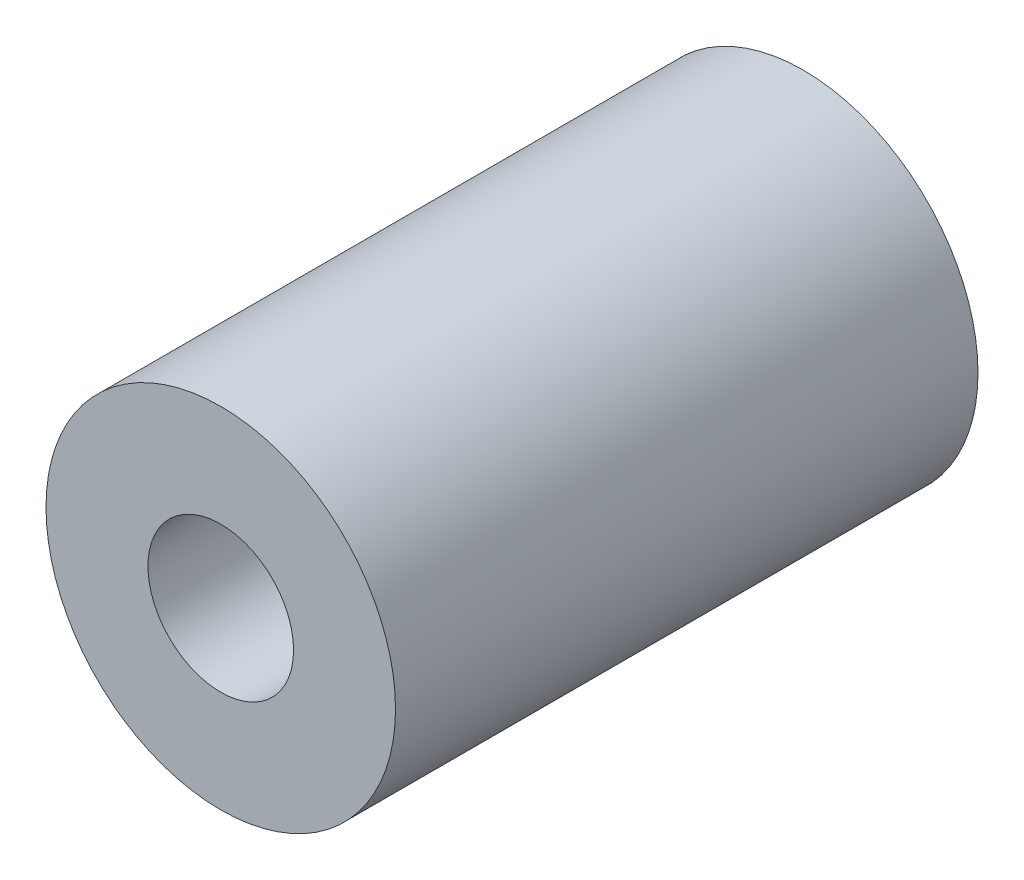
from build123d import *

# Parameters (mm, degrees)
ESQUISSE1_R        = 1.2
ESQUISSE1_R_2      = 0.5
BOSS_EXTRU_1_DEPTH = 2


with BuildPart() as part:
    # Esquisse1 → Boss.-Extru.1 (new, symmetric)
    with BuildSketch(Plane.XY):
        Circle(ESQUISSE1_R)
        Circle(ESQUISSE1_R_2, mode=Mode.SUBTRACT)
    extrude(amount=BOSS_EXTRU_1_DEPTH, both=True)


solid = part.part
